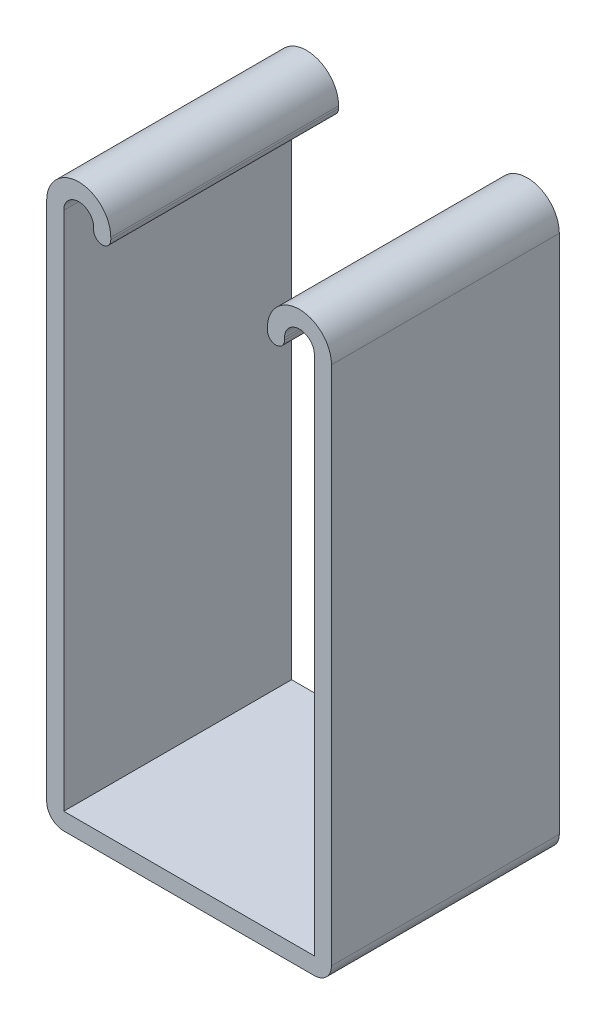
ISO-10303-21;
HEADER;
FILE_DESCRIPTION(('STEP AP214'),'2;1');
FILE_NAME('part.step','',(''),(''),'','','');
FILE_SCHEMA(('AUTOMOTIVE_DESIGN { 1 0 10303 214 1 1 1 1 }'));
ENDSEC;
DATA;
#1=APPLICATION_CONTEXT('core data for automotive mechanical design processes');
#2=APPLICATION_PROTOCOL_DEFINITION('international standard','automotive_design',2000,#1);
#3=PRODUCT_CONTEXT('',#1,'mechanical');
#4=PRODUCT('Part','Part','',(#3));
#5=PRODUCT_RELATED_PRODUCT_CATEGORY('part','',(#4));
#6=PRODUCT_DEFINITION_FORMATION('','',#4);
#7=PRODUCT_DEFINITION_CONTEXT('part definition',#1,'design');
#8=PRODUCT_DEFINITION('design','',#6,#7);
#9=PRODUCT_DEFINITION_SHAPE('','',#8);
#10=(LENGTH_UNIT() NAMED_UNIT(*) SI_UNIT(.MILLI.,.METRE.));
#11=(NAMED_UNIT(*) PLANE_ANGLE_UNIT() SI_UNIT($,.RADIAN.));
#12=(NAMED_UNIT(*) SI_UNIT($,.STERADIAN.) SOLID_ANGLE_UNIT());
#13=UNCERTAINTY_MEASURE_WITH_UNIT(LENGTH_MEASURE(1.E-05),#10,'distance_accuracy_value','');
#14=(GEOMETRIC_REPRESENTATION_CONTEXT(3) GLOBAL_UNCERTAINTY_ASSIGNED_CONTEXT((#13)) GLOBAL_UNIT_ASSIGNED_CONTEXT((#10,
#11,#12)) REPRESENTATION_CONTEXT('',''));
#15=CARTESIAN_POINT('',(0.,0.,0.));
#16=DIRECTION('',(0.,0.,1.));
#17=DIRECTION('',(1.,0.,0.));
#18=AXIS2_PLACEMENT_3D('',#15,#16,#17);
#19=CARTESIAN_POINT('',(-12.303125,30.692725,12.7));
#20=DIRECTION('',(0.,0.,-1.));
#21=DIRECTION('',(-1.,0.,0.));
#22=AXIS2_PLACEMENT_3D('',#19,#20,#21);
#23=CYLINDRICAL_SURFACE('',#22,3.571875);
#24=CARTESIAN_POINT('',(-12.303125,30.692725,-12.7));
#25=DIRECTION('',(0.,0.,1.));
#26=DIRECTION('',(-1.,0.,0.));
#27=AXIS2_PLACEMENT_3D('',#24,#25,#26);
#28=CIRCLE('',#27,3.571875);
#29=CARTESIAN_POINT('',(-8.73125,30.692725,-12.7));
#30=VERTEX_POINT('',#29);
#31=CARTESIAN_POINT('',(-15.875,30.692725,-12.7));
#32=VERTEX_POINT('',#31);
#33=EDGE_CURVE('E188',#30,#32,#28,.T.);
#34=ORIENTED_EDGE('',*,*,#33,.T.);
#35=DIRECTION('',(0.,0.,-1.));
#36=VECTOR('',#35,1.);
#37=CARTESIAN_POINT('',(-15.875,30.692725,12.7));
#38=LINE('',#37,#36);
#39=CARTESIAN_POINT('',(-15.875,30.692725,12.7));
#40=VERTEX_POINT('',#39);
#41=EDGE_CURVE('E11',#40,#32,#38,.T.);
#42=ORIENTED_EDGE('',*,*,#41,.F.);
#43=CARTESIAN_POINT('',(-12.303125,30.692725,12.7));
#44=DIRECTION('',(0.,0.,1.));
#45=DIRECTION('',(-1.,0.,0.));
#46=AXIS2_PLACEMENT_3D('',#43,#44,#45);
#47=CIRCLE('',#46,3.571875);
#48=CARTESIAN_POINT('',(-8.73125,30.692725,12.7));
#49=VERTEX_POINT('',#48);
#50=EDGE_CURVE('E222',#49,#40,#47,.T.);
#51=ORIENTED_EDGE('',*,*,#50,.F.);
#52=DIRECTION('',(0.,0.,-1.));
#53=VECTOR('',#52,1.);
#54=CARTESIAN_POINT('',(-8.73125,30.692725,12.7));
#55=LINE('',#54,#53);
#56=EDGE_CURVE('E184',#49,#30,#55,.T.);
#57=ORIENTED_EDGE('',*,*,#56,.T.);
#58=EDGE_LOOP('',(#34,#42,#51,#57));
#59=FACE_BOUND('',#58,.T.);
#60=ADVANCED_FACE('F32',(#59),#23,.T.);
#61=CARTESIAN_POINT('',(-15.875,30.692725,12.7));
#62=DIRECTION('',(1.,0.,0.));
#63=DIRECTION('',(0.,1.,0.));
#64=AXIS2_PLACEMENT_3D('',#61,#62,#63);
#65=PLANE('',#64);
#66=DIRECTION('',(0.,-1.,0.));
#67=VECTOR('',#66,1.);
#68=CARTESIAN_POINT('',(-15.875,30.692725,-12.7));
#69=LINE('',#68,#67);
#70=CARTESIAN_POINT('',(-15.875,-27.3304,-12.7));
#71=VERTEX_POINT('',#70);
#72=EDGE_CURVE('E191',#32,#71,#69,.T.);
#73=ORIENTED_EDGE('',*,*,#72,.T.);
#74=DIRECTION('',(0.,0.,-1.));
#75=VECTOR('',#74,1.);
#76=CARTESIAN_POINT('',(-15.875,-27.3304,12.7));
#77=LINE('',#76,#75);
#78=CARTESIAN_POINT('',(-15.875,-27.3304,12.7));
#79=VERTEX_POINT('',#78);
#80=EDGE_CURVE('E40',#79,#71,#77,.T.);
#81=ORIENTED_EDGE('',*,*,#80,.F.);
#82=DIRECTION('',(0.,-1.,0.));
#83=VECTOR('',#82,1.);
#84=CARTESIAN_POINT('',(-15.875,30.692725,12.7));
#85=LINE('',#84,#83);
#86=EDGE_CURVE('E121',#40,#79,#85,.T.);
#87=ORIENTED_EDGE('',*,*,#86,.F.);
#88=ORIENTED_EDGE('',*,*,#41,.T.);
#89=EDGE_LOOP('',(#73,#81,#87,#88));
#90=FACE_BOUND('',#89,.T.);
#91=ADVANCED_FACE('F330',(#90),#65,.F.);
#92=CARTESIAN_POINT('',(-13.97,-27.3304,12.7));
#93=DIRECTION('',(0.,0.,-1.));
#94=DIRECTION('',(-1.,0.,0.));
#95=AXIS2_PLACEMENT_3D('',#92,#93,#94);
#96=CYLINDRICAL_SURFACE('',#95,1.905);
#97=CARTESIAN_POINT('',(-13.97,-27.3304,-12.7));
#98=DIRECTION('',(0.,0.,1.));
#99=DIRECTION('',(-1.,0.,0.));
#100=AXIS2_PLACEMENT_3D('',#97,#98,#99);
#101=CIRCLE('',#100,1.905);
#102=CARTESIAN_POINT('',(-13.97,-29.2354,-12.7));
#103=VERTEX_POINT('',#102);
#104=EDGE_CURVE('E193',#71,#103,#101,.T.);
#105=ORIENTED_EDGE('',*,*,#104,.T.);
#106=DIRECTION('',(0.,0.,-1.));
#107=VECTOR('',#106,1.);
#108=CARTESIAN_POINT('',(-13.97,-29.2354,12.7));
#109=LINE('',#108,#107);
#110=CARTESIAN_POINT('',(-13.97,-29.2354,12.7));
#111=VERTEX_POINT('',#110);
#112=EDGE_CURVE('E259',#111,#103,#109,.T.);
#113=ORIENTED_EDGE('',*,*,#112,.F.);
#114=CARTESIAN_POINT('',(-13.97,-27.3304,12.7));
#115=DIRECTION('',(0.,0.,1.));
#116=DIRECTION('',(-1.,0.,0.));
#117=AXIS2_PLACEMENT_3D('',#114,#115,#116);
#118=CIRCLE('',#117,1.905);
#119=EDGE_CURVE('E267',#79,#111,#118,.T.);
#120=ORIENTED_EDGE('',*,*,#119,.F.);
#121=ORIENTED_EDGE('',*,*,#80,.T.);
#122=EDGE_LOOP('',(#105,#113,#120,#121));
#123=FACE_BOUND('',#122,.T.);
#124=ADVANCED_FACE('F265',(#123),#96,.T.);
#125=CARTESIAN_POINT('',(-13.97,-29.2354,12.7));
#126=DIRECTION('',(0.,1.,0.));
#127=DIRECTION('',(0.,0.,1.));
#128=AXIS2_PLACEMENT_3D('',#125,#126,#127);
#129=PLANE('',#128);
#130=DIRECTION('',(1.,0.,0.));
#131=VECTOR('',#130,1.);
#132=CARTESIAN_POINT('',(-13.97,-29.2354,-12.7));
#133=LINE('',#132,#131);
#134=CARTESIAN_POINT('',(13.97,-29.2354,-12.7));
#135=VERTEX_POINT('',#134);
#136=EDGE_CURVE('E195',#103,#135,#133,.T.);
#137=ORIENTED_EDGE('',*,*,#136,.T.);
#138=DIRECTION('',(0.,0.,-1.));
#139=VECTOR('',#138,1.);
#140=CARTESIAN_POINT('',(13.97,-29.2354,12.7));
#141=LINE('',#140,#139);
#142=CARTESIAN_POINT('',(13.97,-29.2354,12.7));
#143=VERTEX_POINT('',#142);
#144=EDGE_CURVE('E256',#143,#135,#141,.T.);
#145=ORIENTED_EDGE('',*,*,#144,.F.);
#146=DIRECTION('',(1.,0.,0.));
#147=VECTOR('',#146,1.);
#148=CARTESIAN_POINT('',(-13.97,-29.2354,12.7));
#149=LINE('',#148,#147);
#150=EDGE_CURVE('E285',#111,#143,#149,.T.);
#151=ORIENTED_EDGE('',*,*,#150,.F.);
#152=ORIENTED_EDGE('',*,*,#112,.T.);
#153=EDGE_LOOP('',(#137,#145,#151,#152));
#154=FACE_BOUND('',#153,.T.);
#155=ADVANCED_FACE('F276',(#154),#129,.F.);
#156=CARTESIAN_POINT('',(13.97,-27.3304,12.7));
#157=DIRECTION('',(0.,0.,-1.));
#158=DIRECTION('',(-1.,0.,0.));
#159=AXIS2_PLACEMENT_3D('',#156,#157,#158);
#160=CYLINDRICAL_SURFACE('',#159,1.905);
#161=CARTESIAN_POINT('',(13.97,-27.3304,-12.7));
#162=DIRECTION('',(0.,0.,1.));
#163=DIRECTION('',(1.,0.,0.));
#164=AXIS2_PLACEMENT_3D('',#161,#162,#163);
#165=CIRCLE('',#164,1.905);
#166=CARTESIAN_POINT('',(15.875,-27.3304,-12.7));
#167=VERTEX_POINT('',#166);
#168=EDGE_CURVE('E197',#135,#167,#165,.T.);
#169=ORIENTED_EDGE('',*,*,#168,.T.);
#170=DIRECTION('',(0.,0.,-1.));
#171=VECTOR('',#170,1.);
#172=CARTESIAN_POINT('',(15.875,-27.3304,12.7));
#173=LINE('',#172,#171);
#174=CARTESIAN_POINT('',(15.875,-27.3304,12.7));
#175=VERTEX_POINT('',#174);
#176=EDGE_CURVE('E253',#175,#167,#173,.T.);
#177=ORIENTED_EDGE('',*,*,#176,.F.);
#178=CARTESIAN_POINT('',(13.97,-27.3304,12.7));
#179=DIRECTION('',(0.,0.,1.));
#180=DIRECTION('',(1.,0.,0.));
#181=AXIS2_PLACEMENT_3D('',#178,#179,#180);
#182=CIRCLE('',#181,1.905);
#183=EDGE_CURVE('E282',#143,#175,#182,.T.);
#184=ORIENTED_EDGE('',*,*,#183,.F.);
#185=ORIENTED_EDGE('',*,*,#144,.T.);
#186=EDGE_LOOP('',(#169,#177,#184,#185));
#187=FACE_BOUND('',#186,.T.);
#188=ADVANCED_FACE('F280',(#187),#160,.T.);
#189=CARTESIAN_POINT('',(15.875,-27.3304,12.7));
#190=DIRECTION('',(-1.,0.,0.));
#191=DIRECTION('',(0.,0.,1.));
#192=AXIS2_PLACEMENT_3D('',#189,#190,#191);
#193=PLANE('',#192);
#194=DIRECTION('',(0.,1.,0.));
#195=VECTOR('',#194,1.);
#196=CARTESIAN_POINT('',(15.875,-27.3304,-12.7));
#197=LINE('',#196,#195);
#198=CARTESIAN_POINT('',(15.875,30.692725,-12.7));
#199=VERTEX_POINT('',#198);
#200=EDGE_CURVE('E199',#167,#199,#197,.T.);
#201=ORIENTED_EDGE('',*,*,#200,.T.);
#202=DIRECTION('',(0.,0.,-1.));
#203=VECTOR('',#202,1.);
#204=CARTESIAN_POINT('',(15.875,30.692725,12.7));
#205=LINE('',#204,#203);
#206=CARTESIAN_POINT('',(15.875,30.692725,12.7));
#207=VERTEX_POINT('',#206);
#208=EDGE_CURVE('E250',#207,#199,#205,.T.);
#209=ORIENTED_EDGE('',*,*,#208,.F.);
#210=DIRECTION('',(0.,1.,0.));
#211=VECTOR('',#210,1.);
#212=CARTESIAN_POINT('',(15.875,-27.3304,12.7));
#213=LINE('',#212,#211);
#214=EDGE_CURVE('E284',#175,#207,#213,.T.);
#215=ORIENTED_EDGE('',*,*,#214,.F.);
#216=ORIENTED_EDGE('',*,*,#176,.T.);
#217=EDGE_LOOP('',(#201,#209,#215,#216));
#218=FACE_BOUND('',#217,.T.);
#219=ADVANCED_FACE('F343',(#218),#193,.F.);
#220=CARTESIAN_POINT('',(12.303125,30.692725,12.7));
#221=DIRECTION('',(0.,0.,-1.));
#222=DIRECTION('',(-1.,0.,0.));
#223=AXIS2_PLACEMENT_3D('',#220,#221,#222);
#224=CYLINDRICAL_SURFACE('',#223,3.571875);
#225=CARTESIAN_POINT('',(12.303125,30.692725,-12.7));
#226=DIRECTION('',(0.,0.,1.));
#227=DIRECTION('',(1.,0.,0.));
#228=AXIS2_PLACEMENT_3D('',#225,#226,#227);
#229=CIRCLE('',#228,3.571875);
#230=CARTESIAN_POINT('',(8.73125,30.692725,-12.7));
#231=VERTEX_POINT('',#230);
#232=EDGE_CURVE('E201',#199,#231,#229,.T.);
#233=ORIENTED_EDGE('',*,*,#232,.T.);
#234=DIRECTION('',(0.,0.,-1.));
#235=VECTOR('',#234,1.);
#236=CARTESIAN_POINT('',(8.73125,30.692725,12.7));
#237=LINE('',#236,#235);
#238=CARTESIAN_POINT('',(8.73125,30.692725,12.7));
#239=VERTEX_POINT('',#238);
#240=EDGE_CURVE('E247',#239,#231,#237,.T.);
#241=ORIENTED_EDGE('',*,*,#240,.F.);
#242=CARTESIAN_POINT('',(12.303125,30.692725,12.7));
#243=DIRECTION('',(0.,0.,1.));
#244=DIRECTION('',(1.,0.,0.));
#245=AXIS2_PLACEMENT_3D('',#242,#243,#244);
#246=CIRCLE('',#245,3.571875);
#247=EDGE_CURVE('E287',#207,#239,#246,.T.);
#248=ORIENTED_EDGE('',*,*,#247,.F.);
#249=ORIENTED_EDGE('',*,*,#208,.T.);
#250=EDGE_LOOP('',(#233,#241,#248,#249));
#251=FACE_BOUND('',#250,.T.);
#252=ADVANCED_FACE('F346',(#251),#224,.T.);
#253=CARTESIAN_POINT('',(8.73125,30.692725,12.7));
#254=DIRECTION('',(1.,0.,0.));
#255=DIRECTION('',(0.,1.,0.));
#256=AXIS2_PLACEMENT_3D('',#253,#254,#255);
#257=PLANE('',#256);
#258=DIRECTION('',(0.,-1.,0.));
#259=VECTOR('',#258,1.);
#260=CARTESIAN_POINT('',(8.73125,30.692725,-12.7));
#261=LINE('',#260,#259);
#262=CARTESIAN_POINT('',(8.73124999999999,30.4546,-12.7));
#263=VERTEX_POINT('',#262);
#264=EDGE_CURVE('E203',#231,#263,#261,.T.);
#265=ORIENTED_EDGE('',*,*,#264,.T.);
#266=DIRECTION('',(0.,0.,-1.));
#267=VECTOR('',#266,1.);
#268=CARTESIAN_POINT('',(8.73124999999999,30.4546,12.7));
#269=LINE('',#268,#267);
#270=CARTESIAN_POINT('',(8.73124999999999,30.4546,12.7));
#271=VERTEX_POINT('',#270);
#272=EDGE_CURVE('E244',#271,#263,#269,.T.);
#273=ORIENTED_EDGE('',*,*,#272,.F.);
#274=DIRECTION('',(0.,-1.,0.));
#275=VECTOR('',#274,1.);
#276=CARTESIAN_POINT('',(8.73125,30.692725,12.7));
#277=LINE('',#276,#275);
#278=EDGE_CURVE('E293',#239,#271,#277,.T.);
#279=ORIENTED_EDGE('',*,*,#278,.F.);
#280=ORIENTED_EDGE('',*,*,#240,.T.);
#281=EDGE_LOOP('',(#265,#273,#279,#280));
#282=FACE_BOUND('',#281,.T.);
#283=ADVANCED_FACE('F350',(#282),#257,.F.);
#284=CARTESIAN_POINT('',(9.68375,30.4546,12.7));
#285=DIRECTION('',(0.,0.,-1.));
#286=DIRECTION('',(-1.,0.,0.));
#287=AXIS2_PLACEMENT_3D('',#284,#285,#286);
#288=CYLINDRICAL_SURFACE('',#287,0.952500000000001);
#289=CARTESIAN_POINT('',(9.68375,30.4546,-12.7));
#290=DIRECTION('',(0.,0.,1.));
#291=DIRECTION('',(1.,0.,0.));
#292=AXIS2_PLACEMENT_3D('',#289,#290,#291);
#293=CIRCLE('',#292,0.952500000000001);
#294=CARTESIAN_POINT('',(10.63625,30.4546,-12.7));
#295=VERTEX_POINT('',#294);
#296=EDGE_CURVE('E205',#263,#295,#293,.T.);
#297=ORIENTED_EDGE('',*,*,#296,.T.);
#298=DIRECTION('',(0.,0.,-1.));
#299=VECTOR('',#298,1.);
#300=CARTESIAN_POINT('',(10.63625,30.4546,12.7));
#301=LINE('',#300,#299);
#302=CARTESIAN_POINT('',(10.63625,30.4546,12.7));
#303=VERTEX_POINT('',#302);
#304=EDGE_CURVE('E241',#303,#295,#301,.T.);
#305=ORIENTED_EDGE('',*,*,#304,.F.);
#306=CARTESIAN_POINT('',(9.68375,30.4546,12.7));
#307=DIRECTION('',(0.,0.,1.));
#308=DIRECTION('',(1.,0.,0.));
#309=AXIS2_PLACEMENT_3D('',#306,#307,#308);
#310=CIRCLE('',#309,0.952500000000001);
#311=EDGE_CURVE('E295',#271,#303,#310,.T.);
#312=ORIENTED_EDGE('',*,*,#311,.F.);
#313=ORIENTED_EDGE('',*,*,#272,.T.);
#314=EDGE_LOOP('',(#297,#305,#312,#313));
#315=FACE_BOUND('',#314,.T.);
#316=ADVANCED_FACE('F354',(#315),#288,.T.);
#317=CARTESIAN_POINT('',(10.63625,30.692725,12.7));
#318=DIRECTION('',(-1.,0.,0.));
#319=DIRECTION('',(0.,-1.,0.));
#320=AXIS2_PLACEMENT_3D('',#317,#318,#319);
#321=PLANE('',#320);
#322=DIRECTION('',(0.,1.,0.));
#323=VECTOR('',#322,1.);
#324=CARTESIAN_POINT('',(10.63625,30.692725,-12.7));
#325=LINE('',#324,#323);
#326=CARTESIAN_POINT('',(10.63625,30.692725,-12.7));
#327=VERTEX_POINT('',#326);
#328=EDGE_CURVE('E207',#295,#327,#325,.T.);
#329=ORIENTED_EDGE('',*,*,#328,.T.);
#330=DIRECTION('',(0.,0.,-1.));
#331=VECTOR('',#330,1.);
#332=CARTESIAN_POINT('',(10.63625,30.692725,12.7));
#333=LINE('',#332,#331);
#334=CARTESIAN_POINT('',(10.63625,30.692725,12.7));
#335=VERTEX_POINT('',#334);
#336=EDGE_CURVE('E238',#335,#327,#333,.T.);
#337=ORIENTED_EDGE('',*,*,#336,.F.);
#338=DIRECTION('',(0.,1.,0.));
#339=VECTOR('',#338,1.);
#340=CARTESIAN_POINT('',(10.63625,30.692725,12.7));
#341=LINE('',#340,#339);
#342=EDGE_CURVE('E297',#303,#335,#341,.T.);
#343=ORIENTED_EDGE('',*,*,#342,.F.);
#344=ORIENTED_EDGE('',*,*,#304,.T.);
#345=EDGE_LOOP('',(#329,#337,#343,#344));
#346=FACE_BOUND('',#345,.T.);
#347=ADVANCED_FACE('F358',(#346),#321,.F.);
#348=CARTESIAN_POINT('',(12.303125,30.692725,12.7));
#349=DIRECTION('',(0.,0.,-1.));
#350=DIRECTION('',(-1.,0.,0.));
#351=AXIS2_PLACEMENT_3D('',#348,#349,#350);
#352=CYLINDRICAL_SURFACE('',#351,1.666875);
#353=CARTESIAN_POINT('',(12.303125,30.692725,-12.7));
#354=DIRECTION('',(0.,0.,-1.));
#355=DIRECTION('',(1.,0.,0.));
#356=AXIS2_PLACEMENT_3D('',#353,#354,#355);
#357=CIRCLE('',#356,1.666875);
#358=CARTESIAN_POINT('',(13.97,30.692725,-12.7));
#359=VERTEX_POINT('',#358);
#360=EDGE_CURVE('E209',#327,#359,#357,.T.);
#361=ORIENTED_EDGE('',*,*,#360,.T.);
#362=DIRECTION('',(0.,0.,-1.));
#363=VECTOR('',#362,1.);
#364=CARTESIAN_POINT('',(13.97,30.692725,12.7));
#365=LINE('',#364,#363);
#366=CARTESIAN_POINT('',(13.97,30.692725,12.7));
#367=VERTEX_POINT('',#366);
#368=EDGE_CURVE('E235',#367,#359,#365,.T.);
#369=ORIENTED_EDGE('',*,*,#368,.F.);
#370=CARTESIAN_POINT('',(12.303125,30.692725,12.7));
#371=DIRECTION('',(0.,0.,-1.));
#372=DIRECTION('',(1.,0.,0.));
#373=AXIS2_PLACEMENT_3D('',#370,#371,#372);
#374=CIRCLE('',#373,1.666875);
#375=EDGE_CURVE('E299',#335,#367,#374,.T.);
#376=ORIENTED_EDGE('',*,*,#375,.F.);
#377=ORIENTED_EDGE('',*,*,#336,.T.);
#378=EDGE_LOOP('',(#361,#369,#376,#377));
#379=FACE_BOUND('',#378,.T.);
#380=ADVANCED_FACE('F362',(#379),#352,.F.);
#381=CARTESIAN_POINT('',(13.97,-27.3304,12.7));
#382=DIRECTION('',(1.,0.,0.));
#383=DIRECTION('',(0.,1.,0.));
#384=AXIS2_PLACEMENT_3D('',#381,#382,#383);
#385=PLANE('',#384);
#386=DIRECTION('',(0.,-1.,0.));
#387=VECTOR('',#386,1.);
#388=CARTESIAN_POINT('',(13.97,-27.3304,-12.7));
#389=LINE('',#388,#387);
#390=CARTESIAN_POINT('',(13.97,-27.3304,-12.7));
#391=VERTEX_POINT('',#390);
#392=EDGE_CURVE('E211',#359,#391,#389,.T.);
#393=ORIENTED_EDGE('',*,*,#392,.T.);
#394=DIRECTION('',(0.,0.,-1.));
#395=VECTOR('',#394,1.);
#396=CARTESIAN_POINT('',(13.97,-27.3304,12.7));
#397=LINE('',#396,#395);
#398=CARTESIAN_POINT('',(13.97,-27.3304,12.7));
#399=VERTEX_POINT('',#398);
#400=EDGE_CURVE('E232',#399,#391,#397,.T.);
#401=ORIENTED_EDGE('',*,*,#400,.F.);
#402=DIRECTION('',(0.,-1.,0.));
#403=VECTOR('',#402,1.);
#404=CARTESIAN_POINT('',(13.97,-27.3304,12.7));
#405=LINE('',#404,#403);
#406=EDGE_CURVE('E301',#367,#399,#405,.T.);
#407=ORIENTED_EDGE('',*,*,#406,.F.);
#408=ORIENTED_EDGE('',*,*,#368,.T.);
#409=EDGE_LOOP('',(#393,#401,#407,#408));
#410=FACE_BOUND('',#409,.T.);
#411=ADVANCED_FACE('F366',(#410),#385,.F.);
#412=CARTESIAN_POINT('',(-13.97,-27.3304,12.7));
#413=DIRECTION('',(0.,-1.,0.));
#414=DIRECTION('',(0.,0.,-1.));
#415=AXIS2_PLACEMENT_3D('',#412,#413,#414);
#416=PLANE('',#415);
#417=DIRECTION('',(-1.,0.,0.));
#418=VECTOR('',#417,1.);
#419=CARTESIAN_POINT('',(-13.97,-27.3304,-12.7));
#420=LINE('',#419,#418);
#421=CARTESIAN_POINT('',(-13.97,-27.3304,-12.7));
#422=VERTEX_POINT('',#421);
#423=EDGE_CURVE('E213',#391,#422,#420,.T.);
#424=ORIENTED_EDGE('',*,*,#423,.T.);
#425=DIRECTION('',(0.,0.,-1.));
#426=VECTOR('',#425,1.);
#427=CARTESIAN_POINT('',(-13.97,-27.3304,12.7));
#428=LINE('',#427,#426);
#429=CARTESIAN_POINT('',(-13.97,-27.3304,12.7));
#430=VERTEX_POINT('',#429);
#431=EDGE_CURVE('E229',#430,#422,#428,.T.);
#432=ORIENTED_EDGE('',*,*,#431,.F.);
#433=DIRECTION('',(-1.,0.,0.));
#434=VECTOR('',#433,1.);
#435=CARTESIAN_POINT('',(-13.97,-27.3304,12.7));
#436=LINE('',#435,#434);
#437=EDGE_CURVE('E303',#399,#430,#436,.T.);
#438=ORIENTED_EDGE('',*,*,#437,.F.);
#439=ORIENTED_EDGE('',*,*,#400,.T.);
#440=EDGE_LOOP('',(#424,#432,#438,#439));
#441=FACE_BOUND('',#440,.T.);
#442=ADVANCED_FACE('F370',(#441),#416,.F.);
#443=CARTESIAN_POINT('',(-13.97,30.692725,12.7));
#444=DIRECTION('',(-1.,0.,0.));
#445=DIRECTION('',(0.,-1.,0.));
#446=AXIS2_PLACEMENT_3D('',#443,#444,#445);
#447=PLANE('',#446);
#448=DIRECTION('',(0.,1.,0.));
#449=VECTOR('',#448,1.);
#450=CARTESIAN_POINT('',(-13.97,30.692725,-12.7));
#451=LINE('',#450,#449);
#452=CARTESIAN_POINT('',(-13.97,30.692725,-12.7));
#453=VERTEX_POINT('',#452);
#454=EDGE_CURVE('E215',#422,#453,#451,.T.);
#455=ORIENTED_EDGE('',*,*,#454,.T.);
#456=DIRECTION('',(0.,0.,-1.));
#457=VECTOR('',#456,1.);
#458=CARTESIAN_POINT('',(-13.97,30.692725,12.7));
#459=LINE('',#458,#457);
#460=CARTESIAN_POINT('',(-13.97,30.692725,12.7));
#461=VERTEX_POINT('',#460);
#462=EDGE_CURVE('E226',#461,#453,#459,.T.);
#463=ORIENTED_EDGE('',*,*,#462,.F.);
#464=DIRECTION('',(0.,1.,0.));
#465=VECTOR('',#464,1.);
#466=CARTESIAN_POINT('',(-13.97,30.692725,12.7));
#467=LINE('',#466,#465);
#468=EDGE_CURVE('E305',#430,#461,#467,.T.);
#469=ORIENTED_EDGE('',*,*,#468,.F.);
#470=ORIENTED_EDGE('',*,*,#431,.T.);
#471=EDGE_LOOP('',(#455,#463,#469,#470));
#472=FACE_BOUND('',#471,.T.);
#473=ADVANCED_FACE('F311',(#472),#447,.F.);
#474=CARTESIAN_POINT('',(-12.303125,30.692725,12.7));
#475=DIRECTION('',(0.,0.,-1.));
#476=DIRECTION('',(-1.,0.,0.));
#477=AXIS2_PLACEMENT_3D('',#474,#475,#476);
#478=CYLINDRICAL_SURFACE('',#477,1.666875);
#479=CARTESIAN_POINT('',(-12.303125,30.692725,-12.7));
#480=DIRECTION('',(0.,0.,-1.));
#481=DIRECTION('',(-1.,0.,0.));
#482=AXIS2_PLACEMENT_3D('',#479,#480,#481);
#483=CIRCLE('',#482,1.666875);
#484=CARTESIAN_POINT('',(-10.63625,30.692725,-12.7));
#485=VERTEX_POINT('',#484);
#486=EDGE_CURVE('E217',#453,#485,#483,.T.);
#487=ORIENTED_EDGE('',*,*,#486,.T.);
#488=DIRECTION('',(0.,0.,-1.));
#489=VECTOR('',#488,1.);
#490=CARTESIAN_POINT('',(-10.63625,30.692725,12.7));
#491=LINE('',#490,#489);
#492=CARTESIAN_POINT('',(-10.63625,30.692725,12.7));
#493=VERTEX_POINT('',#492);
#494=EDGE_CURVE('E179',#493,#485,#491,.T.);
#495=ORIENTED_EDGE('',*,*,#494,.F.);
#496=CARTESIAN_POINT('',(-12.303125,30.692725,12.7));
#497=DIRECTION('',(0.,0.,-1.));
#498=DIRECTION('',(-1.,0.,0.));
#499=AXIS2_PLACEMENT_3D('',#496,#497,#498);
#500=CIRCLE('',#499,1.666875);
#501=EDGE_CURVE('E170',#461,#493,#500,.T.);
#502=ORIENTED_EDGE('',*,*,#501,.F.);
#503=ORIENTED_EDGE('',*,*,#462,.T.);
#504=EDGE_LOOP('',(#487,#495,#502,#503));
#505=FACE_BOUND('',#504,.T.);
#506=ADVANCED_FACE('F315',(#505),#478,.F.);
#507=CARTESIAN_POINT('',(-10.63625,30.692725,12.7));
#508=DIRECTION('',(1.,0.,0.));
#509=DIRECTION('',(0.,0.,-1.));
#510=AXIS2_PLACEMENT_3D('',#507,#508,#509);
#511=PLANE('',#510);
#512=DIRECTION('',(0.,-1.,0.));
#513=VECTOR('',#512,1.);
#514=CARTESIAN_POINT('',(-10.63625,30.692725,-12.7));
#515=LINE('',#514,#513);
#516=CARTESIAN_POINT('',(-10.63625,30.4546,-12.7));
#517=VERTEX_POINT('',#516);
#518=EDGE_CURVE('E178',#485,#517,#515,.T.);
#519=ORIENTED_EDGE('',*,*,#518,.T.);
#520=DIRECTION('',(0.,0.,-1.));
#521=VECTOR('',#520,1.);
#522=CARTESIAN_POINT('',(-10.63625,30.4546,12.7));
#523=LINE('',#522,#521);
#524=CARTESIAN_POINT('',(-10.63625,30.4546,12.7));
#525=VERTEX_POINT('',#524);
#526=EDGE_CURVE('E175',#525,#517,#523,.T.);
#527=ORIENTED_EDGE('',*,*,#526,.F.);
#528=DIRECTION('',(0.,-1.,0.));
#529=VECTOR('',#528,1.);
#530=CARTESIAN_POINT('',(-10.63625,30.692725,12.7));
#531=LINE('',#530,#529);
#532=EDGE_CURVE('E164',#493,#525,#531,.T.);
#533=ORIENTED_EDGE('',*,*,#532,.F.);
#534=ORIENTED_EDGE('',*,*,#494,.T.);
#535=EDGE_LOOP('',(#519,#527,#533,#534));
#536=FACE_BOUND('',#535,.T.);
#537=ADVANCED_FACE('F176',(#536),#511,.F.);
#538=CARTESIAN_POINT('',(-9.68375,30.4546,12.7));
#539=DIRECTION('',(0.,0.,-1.));
#540=DIRECTION('',(-1.,0.,0.));
#541=AXIS2_PLACEMENT_3D('',#538,#539,#540);
#542=CYLINDRICAL_SURFACE('',#541,0.952500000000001);
#543=CARTESIAN_POINT('',(-9.68375,30.4546,-12.7));
#544=DIRECTION('',(0.,0.,1.));
#545=DIRECTION('',(-1.,0.,0.));
#546=AXIS2_PLACEMENT_3D('',#543,#544,#545);
#547=CIRCLE('',#546,0.952500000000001);
#548=CARTESIAN_POINT('',(-8.73125,30.4546,-12.7));
#549=VERTEX_POINT('',#548);
#550=EDGE_CURVE('E107',#517,#549,#547,.T.);
#551=ORIENTED_EDGE('',*,*,#550,.T.);
#552=DIRECTION('',(0.,0.,-1.));
#553=VECTOR('',#552,1.);
#554=CARTESIAN_POINT('',(-8.73125,30.4546,12.7));
#555=LINE('',#554,#553);
#556=CARTESIAN_POINT('',(-8.73125,30.4546,12.7));
#557=VERTEX_POINT('',#556);
#558=EDGE_CURVE('E180',#557,#549,#555,.T.);
#559=ORIENTED_EDGE('',*,*,#558,.F.);
#560=CARTESIAN_POINT('',(-9.68375,30.4546,12.7));
#561=DIRECTION('',(0.,0.,1.));
#562=DIRECTION('',(-1.,0.,0.));
#563=AXIS2_PLACEMENT_3D('',#560,#561,#562);
#564=CIRCLE('',#563,0.952500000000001);
#565=EDGE_CURVE('E168',#525,#557,#564,.T.);
#566=ORIENTED_EDGE('',*,*,#565,.F.);
#567=ORIENTED_EDGE('',*,*,#526,.T.);
#568=EDGE_LOOP('',(#551,#559,#566,#567));
#569=FACE_BOUND('',#568,.T.);
#570=ADVANCED_FACE('F182',(#569),#542,.T.);
#571=CARTESIAN_POINT('',(-8.73125,30.692725,12.7));
#572=DIRECTION('',(-1.,0.,0.));
#573=DIRECTION('',(0.,-1.,0.));
#574=AXIS2_PLACEMENT_3D('',#571,#572,#573);
#575=PLANE('',#574);
#576=DIRECTION('',(0.,1.,0.));
#577=VECTOR('',#576,1.);
#578=CARTESIAN_POINT('',(-8.73125,30.692725,-12.7));
#579=LINE('',#578,#577);
#580=EDGE_CURVE('E113',#549,#30,#579,.T.);
#581=ORIENTED_EDGE('',*,*,#580,.T.);
#582=ORIENTED_EDGE('',*,*,#56,.F.);
#583=DIRECTION('',(0.,1.,0.));
#584=VECTOR('',#583,1.);
#585=CARTESIAN_POINT('',(-8.73125,30.692725,12.7));
#586=LINE('',#585,#584);
#587=EDGE_CURVE('E48',#557,#49,#586,.T.);
#588=ORIENTED_EDGE('',*,*,#587,.F.);
#589=ORIENTED_EDGE('',*,*,#558,.T.);
#590=EDGE_LOOP('',(#581,#582,#588,#589));
#591=FACE_BOUND('',#590,.T.);
#592=ADVANCED_FACE('F319',(#591),#575,.F.);
#593=CARTESIAN_POINT('',(-12.303125,30.692725,12.7));
#594=DIRECTION('',(0.,0.,-1.));
#595=DIRECTION('',(-1.,0.,0.));
#596=AXIS2_PLACEMENT_3D('',#593,#594,#595);
#597=PLANE('',#596);
#598=ORIENTED_EDGE('',*,*,#50,.T.);
#599=ORIENTED_EDGE('',*,*,#86,.T.);
#600=ORIENTED_EDGE('',*,*,#119,.T.);
#601=ORIENTED_EDGE('',*,*,#150,.T.);
#602=ORIENTED_EDGE('',*,*,#183,.T.);
#603=ORIENTED_EDGE('',*,*,#214,.T.);
#604=ORIENTED_EDGE('',*,*,#247,.T.);
#605=ORIENTED_EDGE('',*,*,#278,.T.);
#606=ORIENTED_EDGE('',*,*,#311,.T.);
#607=ORIENTED_EDGE('',*,*,#342,.T.);
#608=ORIENTED_EDGE('',*,*,#375,.T.);
#609=ORIENTED_EDGE('',*,*,#406,.T.);
#610=ORIENTED_EDGE('',*,*,#437,.T.);
#611=ORIENTED_EDGE('',*,*,#468,.T.);
#612=ORIENTED_EDGE('',*,*,#501,.T.);
#613=ORIENTED_EDGE('',*,*,#532,.T.);
#614=ORIENTED_EDGE('',*,*,#565,.T.);
#615=ORIENTED_EDGE('',*,*,#587,.T.);
#616=EDGE_LOOP('',(#598,#599,#600,#601,#602,#603,#604,#605,#606,#607,#608,#609,#610,#611,#612,
#613,#614,#615));
#617=FACE_BOUND('',#616,.T.);
#618=ADVANCED_FACE('F166',(#617),#597,.F.);
#619=CARTESIAN_POINT('',(-12.303125,30.692725,-12.7));
#620=DIRECTION('',(0.,0.,-1.));
#621=DIRECTION('',(-1.,0.,0.));
#622=AXIS2_PLACEMENT_3D('',#619,#620,#621);
#623=PLANE('',#622);
#624=ORIENTED_EDGE('',*,*,#33,.F.);
#625=ORIENTED_EDGE('',*,*,#580,.F.);
#626=ORIENTED_EDGE('',*,*,#550,.F.);
#627=ORIENTED_EDGE('',*,*,#518,.F.);
#628=ORIENTED_EDGE('',*,*,#486,.F.);
#629=ORIENTED_EDGE('',*,*,#454,.F.);
#630=ORIENTED_EDGE('',*,*,#423,.F.);
#631=ORIENTED_EDGE('',*,*,#392,.F.);
#632=ORIENTED_EDGE('',*,*,#360,.F.);
#633=ORIENTED_EDGE('',*,*,#328,.F.);
#634=ORIENTED_EDGE('',*,*,#296,.F.);
#635=ORIENTED_EDGE('',*,*,#264,.F.);
#636=ORIENTED_EDGE('',*,*,#232,.F.);
#637=ORIENTED_EDGE('',*,*,#200,.F.);
#638=ORIENTED_EDGE('',*,*,#168,.F.);
#639=ORIENTED_EDGE('',*,*,#136,.F.);
#640=ORIENTED_EDGE('',*,*,#104,.F.);
#641=ORIENTED_EDGE('',*,*,#72,.F.);
#642=EDGE_LOOP('',(#624,#625,#626,#627,#628,#629,#630,#631,#632,#633,#634,#635,#636,#637,#638,
#639,#640,#641));
#643=FACE_BOUND('',#642,.T.);
#644=ADVANCED_FACE('F271',(#643),#623,.T.);
#645=CLOSED_SHELL('',(#60,#91,#124,#155,#188,#219,#252,#283,#316,#347,#380,#411,#442,#473,#506,
#537,#570,#592,#618,#644));
#646=MANIFOLD_SOLID_BREP('B2',#645);
#647=ADVANCED_BREP_SHAPE_REPRESENTATION('',(#18,#646),#14);
#648=SHAPE_DEFINITION_REPRESENTATION(#9,#647);
ENDSEC;
END-ISO-10303-21;
